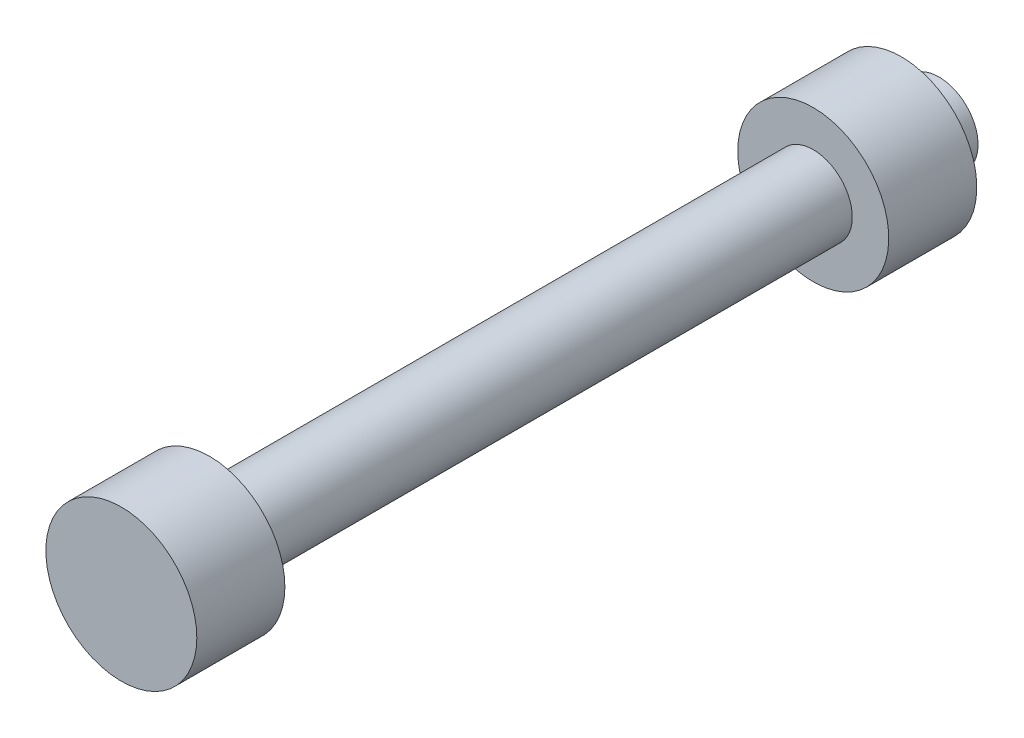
ISO-10303-21;
HEADER;
FILE_DESCRIPTION(('STEP AP214'),'2;1');
FILE_NAME('part.step','',(''),(''),'','','');
FILE_SCHEMA(('AUTOMOTIVE_DESIGN { 1 0 10303 214 1 1 1 1 }'));
ENDSEC;
DATA;
#1=APPLICATION_CONTEXT('core data for automotive mechanical design processes');
#2=APPLICATION_PROTOCOL_DEFINITION('international standard','automotive_design',2000,#1);
#3=PRODUCT_CONTEXT('',#1,'mechanical');
#4=PRODUCT('Part','Part','',(#3));
#5=PRODUCT_RELATED_PRODUCT_CATEGORY('part','',(#4));
#6=PRODUCT_DEFINITION_FORMATION('','',#4);
#7=PRODUCT_DEFINITION_CONTEXT('part definition',#1,'design');
#8=PRODUCT_DEFINITION('design','',#6,#7);
#9=PRODUCT_DEFINITION_SHAPE('','',#8);
#10=(LENGTH_UNIT() NAMED_UNIT(*) SI_UNIT(.MILLI.,.METRE.));
#11=(NAMED_UNIT(*) PLANE_ANGLE_UNIT() SI_UNIT($,.RADIAN.));
#12=(NAMED_UNIT(*) SI_UNIT($,.STERADIAN.) SOLID_ANGLE_UNIT());
#13=UNCERTAINTY_MEASURE_WITH_UNIT(LENGTH_MEASURE(1.E-05),#10,'distance_accuracy_value','');
#14=(GEOMETRIC_REPRESENTATION_CONTEXT(3) GLOBAL_UNCERTAINTY_ASSIGNED_CONTEXT((#13)) GLOBAL_UNIT_ASSIGNED_CONTEXT((#10,
#11,#12)) REPRESENTATION_CONTEXT('',''));
#15=CARTESIAN_POINT('',(0.,0.,0.));
#16=DIRECTION('',(0.,0.,1.));
#17=DIRECTION('',(1.,0.,0.));
#18=AXIS2_PLACEMENT_3D('',#15,#16,#17);
#19=CARTESIAN_POINT('',(0.,0.,-117.114081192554));
#20=DIRECTION('',(0.,0.,1.));
#21=DIRECTION('',(0.,-1.,0.));
#22=AXIS2_PLACEMENT_3D('',#19,#20,#21);
#23=CYLINDRICAL_SURFACE('',#22,4.92379);
#24=CARTESIAN_POINT('',(0.,0.,-11.1125));
#25=DIRECTION('',(0.,0.,-1.));
#26=DIRECTION('',(0.,1.,0.));
#27=AXIS2_PLACEMENT_3D('',#24,#25,#26);
#28=CIRCLE('',#27,4.92379);
#29=CARTESIAN_POINT('',(0.,4.92379,-11.1125));
#30=VERTEX_POINT('',#29);
#31=EDGE_CURVE('E42',#30,#30,#28,.T.);
#32=ORIENTED_EDGE('',*,*,#31,.T.);
#33=EDGE_LOOP('',(#32));
#34=FACE_BOUND('',#33,.T.);
#35=CARTESIAN_POINT('',(0.,0.,-87.3125000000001));
#36=DIRECTION('',(0.,0.,-1.));
#37=DIRECTION('',(0.,1.,0.));
#38=AXIS2_PLACEMENT_3D('',#35,#36,#37);
#39=CIRCLE('',#38,4.92379);
#40=CARTESIAN_POINT('',(0.,4.92379,-87.3125000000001));
#41=VERTEX_POINT('',#40);
#42=EDGE_CURVE('E10',#41,#41,#39,.T.);
#43=ORIENTED_EDGE('',*,*,#42,.F.);
#44=EDGE_LOOP('',(#43));
#45=FACE_BOUND('',#44,.T.);
#46=ADVANCED_FACE('F35',(#34,#45),#23,.T.);
#47=CARTESIAN_POINT('',(-91.027754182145,277.554243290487,-11.1125));
#48=DIRECTION('',(0.,0.,-1.));
#49=DIRECTION('',(0.546944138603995,-0.837169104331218,0.));
#50=AXIS2_PLACEMENT_3D('',#47,#48,#49);
#51=PLANE('',#50);
#52=ORIENTED_EDGE('',*,*,#31,.F.);
#53=EDGE_LOOP('',(#52));
#54=FACE_BOUND('',#53,.T.);
#55=CARTESIAN_POINT('',(0.,0.,-11.1125));
#56=DIRECTION('',(0.,0.,-1.));
#57=DIRECTION('',(0.,1.,0.));
#58=AXIS2_PLACEMENT_3D('',#55,#56,#57);
#59=CIRCLE('',#58,9.52500000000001);
#60=CARTESIAN_POINT('',(0.,9.52500000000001,-11.1125));
#61=VERTEX_POINT('',#60);
#62=EDGE_CURVE('E46',#61,#61,#59,.F.);
#63=ORIENTED_EDGE('',*,*,#62,.F.);
#64=EDGE_LOOP('',(#63));
#65=FACE_BOUND('',#64,.T.);
#66=ADVANCED_FACE('F37',(#54,#65),#51,.T.);
#67=CARTESIAN_POINT('',(0.,0.,0.));
#68=DIRECTION('',(0.,0.,1.));
#69=DIRECTION('',(1.,0.,0.));
#70=AXIS2_PLACEMENT_3D('',#67,#68,#69);
#71=PLANE('',#70);
#72=CARTESIAN_POINT('',(0.,0.,0.));
#73=DIRECTION('',(0.,0.,1.));
#74=DIRECTION('',(1.,0.,0.));
#75=AXIS2_PLACEMENT_3D('',#72,#73,#74);
#76=CIRCLE('',#75,9.52500000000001);
#77=CARTESIAN_POINT('',(9.52500000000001,0.,0.));
#78=VERTEX_POINT('',#77);
#79=EDGE_CURVE('E51',#78,#78,#76,.T.);
#80=ORIENTED_EDGE('',*,*,#79,.T.);
#81=EDGE_LOOP('',(#80));
#82=FACE_BOUND('',#81,.T.);
#83=ADVANCED_FACE('F94',(#82),#71,.T.);
#84=CARTESIAN_POINT('',(0.,0.,-38.0532683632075));
#85=DIRECTION('',(0.,0.,1.));
#86=DIRECTION('',(1.,0.,0.));
#87=AXIS2_PLACEMENT_3D('',#84,#85,#86);
#88=CYLINDRICAL_SURFACE('',#87,9.52500000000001);
#89=ORIENTED_EDGE('',*,*,#79,.F.);
#90=EDGE_LOOP('',(#89));
#91=FACE_BOUND('',#90,.T.);
#92=ORIENTED_EDGE('',*,*,#62,.T.);
#93=EDGE_LOOP('',(#92));
#94=FACE_BOUND('',#93,.T.);
#95=ADVANCED_FACE('F86',(#91,#94),#88,.T.);
#96=CARTESIAN_POINT('',(0.,0.,-125.365768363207));
#97=DIRECTION('',(0.,0.,1.));
#98=DIRECTION('',(0.,-1.,0.));
#99=AXIS2_PLACEMENT_3D('',#96,#97,#98);
#100=CYLINDRICAL_SURFACE('',#99,9.525);
#101=CARTESIAN_POINT('',(0.,0.,-87.3125000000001));
#102=DIRECTION('',(0.,0.,-1.));
#103=DIRECTION('',(0.,1.,0.));
#104=AXIS2_PLACEMENT_3D('',#101,#102,#103);
#105=CIRCLE('',#104,9.525);
#106=CARTESIAN_POINT('',(0.,9.525,-87.3125000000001));
#107=VERTEX_POINT('',#106);
#108=EDGE_CURVE('E66',#107,#107,#105,.T.);
#109=ORIENTED_EDGE('',*,*,#108,.T.);
#110=EDGE_LOOP('',(#109));
#111=FACE_BOUND('',#110,.T.);
#112=CARTESIAN_POINT('',(0.,0.,-98.4249999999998));
#113=DIRECTION('',(0.,0.,-1.));
#114=DIRECTION('',(-1.,0.,0.));
#115=AXIS2_PLACEMENT_3D('',#112,#113,#114);
#116=CIRCLE('',#115,9.525);
#117=CARTESIAN_POINT('',(-9.525,0.,-98.4249999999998));
#118=VERTEX_POINT('',#117);
#119=EDGE_CURVE('E55',#118,#118,#116,.T.);
#120=ORIENTED_EDGE('',*,*,#119,.F.);
#121=EDGE_LOOP('',(#120));
#122=FACE_BOUND('',#121,.T.);
#123=ADVANCED_FACE('F72',(#111,#122),#100,.T.);
#124=CARTESIAN_POINT('',(0.,0.,-87.3125000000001));
#125=DIRECTION('',(0.,0.,-1.));
#126=DIRECTION('',(0.,1.,0.));
#127=AXIS2_PLACEMENT_3D('',#124,#125,#126);
#128=PLANE('',#127);
#129=ORIENTED_EDGE('',*,*,#42,.T.);
#130=EDGE_LOOP('',(#129));
#131=FACE_BOUND('',#130,.T.);
#132=ORIENTED_EDGE('',*,*,#108,.F.);
#133=EDGE_LOOP('',(#132));
#134=FACE_BOUND('',#133,.T.);
#135=ADVANCED_FACE('F75',(#131,#134),#128,.F.);
#136=CARTESIAN_POINT('',(9.81345458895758,-4.96624697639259,-98.4249999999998));
#137=DIRECTION('',(0.,0.,-1.));
#138=DIRECTION('',(-0.546944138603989,0.837169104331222,0.));
#139=AXIS2_PLACEMENT_3D('',#136,#137,#138);
#140=PLANE('',#139);
#141=CARTESIAN_POINT('',(0.,0.,-98.4249999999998));
#142=DIRECTION('',(0.,0.,-1.));
#143=DIRECTION('',(-1.,0.,0.));
#144=AXIS2_PLACEMENT_3D('',#141,#142,#143);
#145=CIRCLE('',#144,4.92379);
#146=CARTESIAN_POINT('',(-4.92379,0.,-98.4249999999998));
#147=VERTEX_POINT('',#146);
#148=EDGE_CURVE('E60',#147,#147,#145,.T.);
#149=ORIENTED_EDGE('',*,*,#148,.F.);
#150=EDGE_LOOP('',(#149));
#151=FACE_BOUND('',#150,.T.);
#152=ORIENTED_EDGE('',*,*,#119,.T.);
#153=EDGE_LOOP('',(#152));
#154=FACE_BOUND('',#153,.T.);
#155=ADVANCED_FACE('F77',(#151,#154),#140,.T.);
#156=CARTESIAN_POINT('',(0.,0.,-103.1875));
#157=DIRECTION('',(0.,0.,-1.));
#158=DIRECTION('',(-1.,0.,0.));
#159=AXIS2_PLACEMENT_3D('',#156,#157,#158);
#160=PLANE('',#159);
#161=CARTESIAN_POINT('',(0.,0.,-103.1875));
#162=DIRECTION('',(0.,0.,-1.));
#163=DIRECTION('',(-1.,0.,0.));
#164=AXIS2_PLACEMENT_3D('',#161,#162,#163);
#165=CIRCLE('',#164,4.92379);
#166=CARTESIAN_POINT('',(-4.92379,0.,-103.1875));
#167=VERTEX_POINT('',#166);
#168=EDGE_CURVE('E57',#167,#167,#165,.T.);
#169=ORIENTED_EDGE('',*,*,#168,.T.);
#170=EDGE_LOOP('',(#169));
#171=FACE_BOUND('',#170,.T.);
#172=ADVANCED_FACE('F83',(#171),#160,.T.);
#173=ORIENTED_EDGE('',*,*,#148,.T.);
#174=EDGE_LOOP('',(#173));
#175=FACE_BOUND('',#174,.T.);
#176=ORIENTED_EDGE('',*,*,#168,.F.);
#177=EDGE_LOOP('',(#176));
#178=FACE_BOUND('',#177,.T.);
#179=ADVANCED_FACE('F90',(#175,#178),#23,.T.);
#180=CLOSED_SHELL('',(#46,#66,#83,#95,#123,#135,#155,#172,#179));
#181=MANIFOLD_SOLID_BREP('B2',#180);
#182=ADVANCED_BREP_SHAPE_REPRESENTATION('',(#18,#181),#14);
#183=SHAPE_DEFINITION_REPRESENTATION(#9,#182);
ENDSEC;
END-ISO-10303-21;
